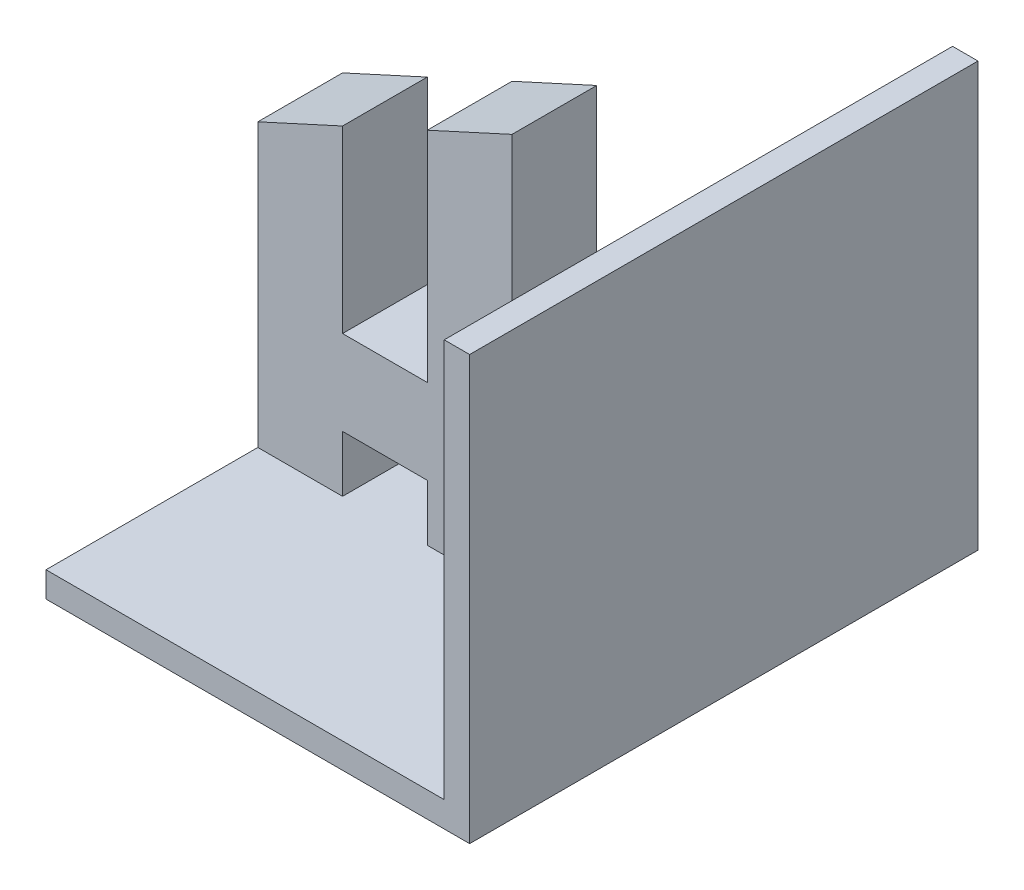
from build123d import *

# Parameters (mm, degrees)
EXTRUDE_THIN1_DEPTH = 30
SKETCH3_W           = 10
SKETCH3_H           = 10
EXTRUDE1_DEPTH      = 47
CUT_EXTRUDE1_START  = -10
CUT_EXTRUDE1_DEPTH  = 10
SKETCH6_W           = 50
SKETCH6_H           = 36.285714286
CUT_EXTRUDE2_DEPTH  = 127.885775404
SKETCH5_W           = 10
SKETCH5_H           = 10
EXTRUDE2_DEPTH      = 37


with BuildPart() as part:
    # Sketch1 → Extrude-Thin1 (new, symmetric)
    with BuildSketch(Plane.XY):
        Polygon((0, 50), (0, 0), (-100, 0), (-100, 3), (-3, 3), (-3, 50), align=None)
    extrude(amount=EXTRUDE_THIN1_DEPTH, both=True)

    # Sketch3 → Extrude1 (add, through all)
    with BuildSketch(Plane(origin=(0, 3, 0), x_dir=(-1, 0, 0), z_dir=(0, 1, 0))):
        with Locations((85, 0)):
            Rectangle(SKETCH3_W, SKETCH3_H)
        with Locations((65, 0)):
            Rectangle(SKETCH3_W, SKETCH3_H)
        with Locations((45, 0)):
            Rectangle(SKETCH3_W, SKETCH3_H)
        with Locations((25, 0)):
            Rectangle(SKETCH3_W, SKETCH3_H)
    extrude(amount=EXTRUDE1_DEPTH)

    # Sketch4 → Cut-Extrude1 (cut)
    with BuildSketch(Plane.XY.offset(5).offset(CUT_EXTRUDE1_START)):
        Polygon((-90, 50), (-20, 50), (-90, 18), align=None)
    extrude(amount=CUT_EXTRUDE1_DEPTH, mode=Mode.SUBTRACT)

    # Sketch6 → Cut-Extrude2 (cut, through all)
    with BuildSketch(Plane.XY.offset(30)):
        with Locations((-75, 18.142857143)):
            Rectangle(SKETCH6_W, SKETCH6_H)
    extrude(amount=-CUT_EXTRUDE2_DEPTH, mode=Mode.SUBTRACT)

    # Sketch5 → Extrude2 (add)
    with BuildSketch(Plane.ZY.offset(3)):
        with Locations((0, 14.642857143)):
            Rectangle(SKETCH5_W, SKETCH5_H)
    extrude(amount=EXTRUDE2_DEPTH)


solid = part.part
